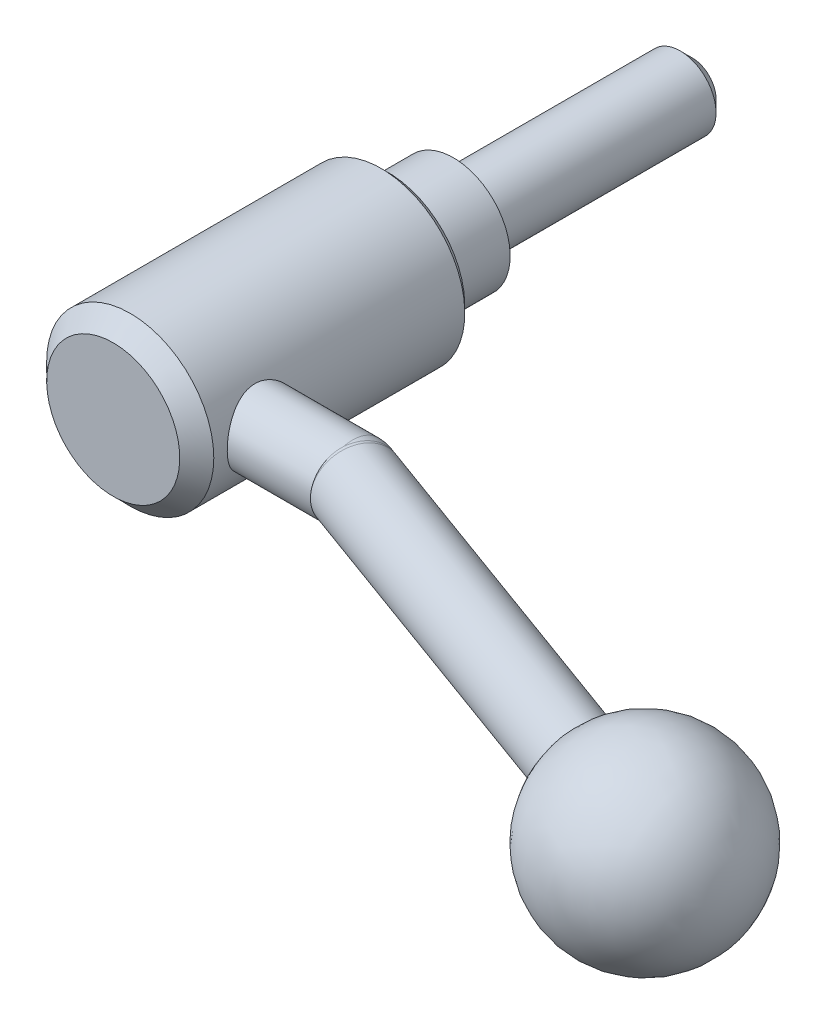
ISO-10303-21;
HEADER;
FILE_DESCRIPTION(('STEP AP214'),'2;1');
FILE_NAME('part.step','',(''),(''),'','','');
FILE_SCHEMA(('AUTOMOTIVE_DESIGN { 1 0 10303 214 1 1 1 1 }'));
ENDSEC;
DATA;
#1=APPLICATION_CONTEXT('core data for automotive mechanical design processes');
#2=APPLICATION_PROTOCOL_DEFINITION('international standard','automotive_design',2000,#1);
#3=PRODUCT_CONTEXT('',#1,'mechanical');
#4=PRODUCT('Part','Part','',(#3));
#5=PRODUCT_RELATED_PRODUCT_CATEGORY('part','',(#4));
#6=PRODUCT_DEFINITION_FORMATION('','',#4);
#7=PRODUCT_DEFINITION_CONTEXT('part definition',#1,'design');
#8=PRODUCT_DEFINITION('design','',#6,#7);
#9=PRODUCT_DEFINITION_SHAPE('','',#8);
#10=(LENGTH_UNIT() NAMED_UNIT(*) SI_UNIT(.MILLI.,.METRE.));
#11=(NAMED_UNIT(*) PLANE_ANGLE_UNIT() SI_UNIT($,.RADIAN.));
#12=(NAMED_UNIT(*) SI_UNIT($,.STERADIAN.) SOLID_ANGLE_UNIT());
#13=UNCERTAINTY_MEASURE_WITH_UNIT(LENGTH_MEASURE(1.E-05),#10,'distance_accuracy_value','');
#14=(GEOMETRIC_REPRESENTATION_CONTEXT(3) GLOBAL_UNCERTAINTY_ASSIGNED_CONTEXT((#13)) GLOBAL_UNIT_ASSIGNED_CONTEXT((#10,
#11,#12)) REPRESENTATION_CONTEXT('',''));
#15=CARTESIAN_POINT('',(0.,0.,0.));
#16=DIRECTION('',(0.,0.,1.));
#17=DIRECTION('',(1.,0.,0.));
#18=AXIS2_PLACEMENT_3D('',#15,#16,#17);
#19=CARTESIAN_POINT('',(0.,0.,-19.463244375));
#20=DIRECTION('',(0.,0.,1.));
#21=DIRECTION('',(0.,-1.,0.));
#22=AXIS2_PLACEMENT_3D('',#19,#20,#21);
#23=CYLINDRICAL_SURFACE('',#22,6.);
#24=CARTESIAN_POINT('',(0.,0.,-38.));
#25=DIRECTION('',(0.,0.,-1.));
#26=DIRECTION('',(-1.,0.,0.));
#27=AXIS2_PLACEMENT_3D('',#24,#25,#26);
#28=CIRCLE('',#27,6.);
#29=CARTESIAN_POINT('',(-6.,0.,-38.));
#30=VERTEX_POINT('',#29);
#31=EDGE_CURVE('E9',#30,#30,#28,.F.);
#32=ORIENTED_EDGE('',*,*,#31,.T.);
#33=EDGE_LOOP('',(#32));
#34=FACE_BOUND('',#33,.T.);
#35=CARTESIAN_POINT('',(0.,0.,0.));
#36=DIRECTION('',(0.,0.,1.));
#37=DIRECTION('',(0.,-1.,0.));
#38=AXIS2_PLACEMENT_3D('',#35,#36,#37);
#39=CIRCLE('',#38,6.);
#40=CARTESIAN_POINT('',(0.,-6.,0.));
#41=VERTEX_POINT('',#40);
#42=EDGE_CURVE('E144',#41,#41,#39,.T.);
#43=ORIENTED_EDGE('',*,*,#42,.F.);
#44=EDGE_LOOP('',(#43));
#45=FACE_BOUND('',#44,.T.);
#46=ADVANCED_FACE('F14',(#34,#45),#23,.T.);
#47=CARTESIAN_POINT('',(7.75,0.,0.));
#48=DIRECTION('',(0.,0.,-1.));
#49=DIRECTION('',(0.,1.,0.));
#50=AXIS2_PLACEMENT_3D('',#47,#48,#49);
#51=PLANE('',#50);
#52=ORIENTED_EDGE('',*,*,#42,.T.);
#53=EDGE_LOOP('',(#52));
#54=FACE_BOUND('',#53,.T.);
#55=CARTESIAN_POINT('',(0.,0.,0.));
#56=DIRECTION('',(0.,0.,1.));
#57=DIRECTION('',(0.,-1.,0.));
#58=AXIS2_PLACEMENT_3D('',#55,#56,#57);
#59=CIRCLE('',#58,9.5);
#60=CARTESIAN_POINT('',(0.,-9.5,0.));
#61=VERTEX_POINT('',#60);
#62=EDGE_CURVE('E141',#61,#61,#59,.T.);
#63=ORIENTED_EDGE('',*,*,#62,.F.);
#64=EDGE_LOOP('',(#63));
#65=FACE_BOUND('',#64,.T.);
#66=ADVANCED_FACE('F148',(#54,#65),#51,.T.);
#67=CARTESIAN_POINT('',(0.,0.,5.5));
#68=DIRECTION('',(0.,0.,1.));
#69=DIRECTION('',(0.,-1.,0.));
#70=AXIS2_PLACEMENT_3D('',#67,#68,#69);
#71=CYLINDRICAL_SURFACE('',#70,9.5);
#72=CARTESIAN_POINT('',(0.,0.,11.));
#73=DIRECTION('',(0.,0.,1.));
#74=DIRECTION('',(0.,-1.,0.));
#75=AXIS2_PLACEMENT_3D('',#72,#73,#74);
#76=CIRCLE('',#75,9.5);
#77=CARTESIAN_POINT('',(0.,-9.5,11.));
#78=VERTEX_POINT('',#77);
#79=EDGE_CURVE('E136',#78,#78,#76,.T.);
#80=ORIENTED_EDGE('',*,*,#79,.F.);
#81=EDGE_LOOP('',(#80));
#82=FACE_BOUND('',#81,.T.);
#83=ORIENTED_EDGE('',*,*,#62,.T.);
#84=EDGE_LOOP('',(#83));
#85=FACE_BOUND('',#84,.T.);
#86=ADVANCED_FACE('F158',(#82,#85),#71,.T.);
#87=CARTESIAN_POINT('',(11.2,0.,11.));
#88=DIRECTION('',(0.,0.,-1.));
#89=DIRECTION('',(0.,1.,0.));
#90=AXIS2_PLACEMENT_3D('',#87,#88,#89);
#91=PLANE('',#90);
#92=ORIENTED_EDGE('',*,*,#79,.T.);
#93=EDGE_LOOP('',(#92));
#94=FACE_BOUND('',#93,.T.);
#95=CARTESIAN_POINT('',(0.,0.,11.));
#96=DIRECTION('',(0.,0.,1.));
#97=DIRECTION('',(0.,-1.,0.));
#98=AXIS2_PLACEMENT_3D('',#95,#96,#97);
#99=CIRCLE('',#98,12.9);
#100=CARTESIAN_POINT('',(0.,-12.9,11.));
#101=VERTEX_POINT('',#100);
#102=EDGE_CURVE('E134',#101,#101,#99,.T.);
#103=ORIENTED_EDGE('',*,*,#102,.F.);
#104=EDGE_LOOP('',(#103));
#105=FACE_BOUND('',#104,.T.);
#106=ADVANCED_FACE('F163',(#94,#105),#91,.T.);
#107=CARTESIAN_POINT('',(5.575,0.,57.));
#108=DIRECTION('',(0.,0.,1.));
#109=DIRECTION('',(0.,-1.,0.));
#110=AXIS2_PLACEMENT_3D('',#107,#108,#109);
#111=PLANE('',#110);
#112=CARTESIAN_POINT('',(0.,0.,57.));
#113=DIRECTION('',(0.,0.,-1.));
#114=DIRECTION('',(0.,1.,0.));
#115=AXIS2_PLACEMENT_3D('',#112,#113,#114);
#116=CIRCLE('',#115,11.15);
#117=CARTESIAN_POINT('',(0.,11.15,57.));
#118=VERTEX_POINT('',#117);
#119=EDGE_CURVE('E118',#118,#118,#116,.T.);
#120=ORIENTED_EDGE('',*,*,#119,.F.);
#121=EDGE_LOOP('',(#120));
#122=FACE_BOUND('',#121,.T.);
#123=ADVANCED_FACE('F167',(#122),#111,.T.);
#124=CARTESIAN_POINT('',(0.,0.,12.1));
#125=DIRECTION('',(0.,0.,1.));
#126=DIRECTION('',(0.,-1.,0.));
#127=AXIS2_PLACEMENT_3D('',#124,#125,#126);
#128=CONICAL_SURFACE('',#127,14.,0.785398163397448);
#129=ORIENTED_EDGE('',*,*,#102,.T.);
#130=EDGE_LOOP('',(#129));
#131=FACE_BOUND('',#130,.T.);
#132=CARTESIAN_POINT('',(0.,0.,12.1));
#133=DIRECTION('',(0.,0.,1.));
#134=DIRECTION('',(0.,-1.,0.));
#135=AXIS2_PLACEMENT_3D('',#132,#133,#134);
#136=CIRCLE('',#135,14.);
#137=CARTESIAN_POINT('',(0.,-14.,12.1));
#138=VERTEX_POINT('',#137);
#139=EDGE_CURVE('E111',#138,#138,#136,.T.);
#140=ORIENTED_EDGE('',*,*,#139,.F.);
#141=EDGE_LOOP('',(#140));
#142=FACE_BOUND('',#141,.T.);
#143=ADVANCED_FACE('F129',(#131,#142),#128,.T.);
#144=CARTESIAN_POINT('',(0.,0.,54.15));
#145=DIRECTION('',(0.,0.,-1.));
#146=DIRECTION('',(0.,1.,0.));
#147=AXIS2_PLACEMENT_3D('',#144,#145,#146);
#148=CONICAL_SURFACE('',#147,14.,0.785398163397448);
#149=CARTESIAN_POINT('',(0.,0.,54.15));
#150=DIRECTION('',(0.,0.,1.));
#151=DIRECTION('',(0.,-1.,0.));
#152=AXIS2_PLACEMENT_3D('',#149,#150,#151);
#153=CIRCLE('',#152,14.);
#154=CARTESIAN_POINT('',(0.,-14.,54.15));
#155=VERTEX_POINT('',#154);
#156=EDGE_CURVE('E47',#155,#155,#153,.F.);
#157=ORIENTED_EDGE('',*,*,#156,.F.);
#158=EDGE_LOOP('',(#157));
#159=FACE_BOUND('',#158,.T.);
#160=ORIENTED_EDGE('',*,*,#119,.T.);
#161=EDGE_LOOP('',(#160));
#162=FACE_BOUND('',#161,.T.);
#163=ADVANCED_FACE('F126',(#159,#162),#148,.T.);
#164=CARTESIAN_POINT('',(0.,0.,33.125));
#165=DIRECTION('',(0.,0.,1.));
#166=DIRECTION('',(0.,-1.,0.));
#167=AXIS2_PLACEMENT_3D('',#164,#165,#166);
#168=CYLINDRICAL_SURFACE('',#167,14.);
#169=ORIENTED_EDGE('',*,*,#139,.T.);
#170=EDGE_LOOP('',(#169));
#171=FACE_BOUND('',#170,.T.);
#172=ORIENTED_EDGE('',*,*,#156,.T.);
#173=EDGE_LOOP('',(#172));
#174=FACE_BOUND('',#173,.T.);
#175=CARTESIAN_POINT('',(12.6491106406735,-6.,45.9));
#176=CARTESIAN_POINT('',(12.64910460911,-6.00000553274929,45.7401576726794));
#177=CARTESIAN_POINT('',(12.6521467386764,-5.99360993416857,45.5803670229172));
#178=CARTESIAN_POINT('',(12.6641937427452,-5.96811672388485,45.2619820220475));
#179=CARTESIAN_POINT('',(12.6731994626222,-5.94901731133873,45.103387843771));
#180=CARTESIAN_POINT('',(12.6968742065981,-5.89831833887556,44.7885665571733));
#181=CARTESIAN_POINT('',(12.7115461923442,-5.86671224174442,44.6323407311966));
#182=CARTESIAN_POINT('',(12.746064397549,-5.79133489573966,44.3233778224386));
#183=CARTESIAN_POINT('',(12.7659126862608,-5.74755878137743,44.1706421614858));
#184=CARTESIAN_POINT('',(12.8100610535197,-5.64847418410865,43.870311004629));
#185=CARTESIAN_POINT('',(12.834343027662,-5.59321247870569,43.7226974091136));
#186=CARTESIAN_POINT('',(12.8866851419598,-5.47153830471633,43.432812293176));
#187=CARTESIAN_POINT('',(12.9147467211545,-5.4051215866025,43.2905428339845));
#188=CARTESIAN_POINT('',(13.0034189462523,-5.18991043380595,42.8730011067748));
#189=CARTESIAN_POINT('',(13.0685550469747,-5.02507375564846,42.6067513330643));
#190=CARTESIAN_POINT('',(13.2082253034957,-4.64606613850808,42.0890653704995));
#191=CARTESIAN_POINT('',(13.2830881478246,-4.42954152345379,41.8394560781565));
#192=CARTESIAN_POINT('',(13.4311388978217,-3.95795352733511,41.3785903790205));
#193=CARTESIAN_POINT('',(13.5043260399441,-3.70287296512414,41.1673511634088));
#194=CARTESIAN_POINT('',(13.6088643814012,-3.28944046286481,40.8790751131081));
#195=CARTESIAN_POINT('',(13.6435464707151,-3.14284381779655,40.7860210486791));
#196=CARTESIAN_POINT('',(13.7094572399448,-2.84156827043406,40.6126899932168));
#197=CARTESIAN_POINT('',(13.7406873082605,-2.68689265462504,40.5324078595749));
#198=CARTESIAN_POINT('',(13.7987727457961,-2.37059090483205,40.3854112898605));
#199=CARTESIAN_POINT('',(13.8256317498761,-2.20897068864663,40.3186855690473));
#200=CARTESIAN_POINT('',(13.8742091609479,-1.87989388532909,40.199418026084));
#201=CARTESIAN_POINT('',(13.8959288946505,-1.71243881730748,40.14687254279));
#202=CARTESIAN_POINT('',(13.9424931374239,-1.29234447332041,40.0351169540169));
#203=CARTESIAN_POINT('',(13.9639369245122,-1.03695928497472,39.9845583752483));
#204=CARTESIAN_POINT('',(13.9926857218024,-0.521004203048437,39.9170068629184));
#205=CARTESIAN_POINT('',(13.9999930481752,-0.260435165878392,39.9000084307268));
#206=CARTESIAN_POINT('',(14.0000042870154,0.160603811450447,39.899994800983));
#207=CARTESIAN_POINT('',(13.9972323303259,0.321156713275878,39.9064506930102));
#208=CARTESIAN_POINT('',(13.9862285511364,0.641089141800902,39.9321914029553));
#209=CARTESIAN_POINT('',(13.9779959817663,0.80046850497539,39.9514779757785));
#210=CARTESIAN_POINT('',(13.9562800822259,1.11687883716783,40.0026881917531));
#211=CARTESIAN_POINT('',(13.9427945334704,1.27390878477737,40.0346171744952));
#212=CARTESIAN_POINT('',(13.9109210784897,1.58450451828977,40.1107925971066));
#213=CARTESIAN_POINT('',(13.8925312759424,1.73806893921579,40.1550438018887));
#214=CARTESIAN_POINT('',(13.8513869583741,2.04015832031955,40.2552679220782));
#215=CARTESIAN_POINT('',(13.8286466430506,2.1886978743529,40.3112027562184));
#216=CARTESIAN_POINT('',(13.7793155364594,2.48039457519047,40.4344055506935));
#217=CARTESIAN_POINT('',(13.7527233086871,2.62354968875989,40.5016777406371));
#218=CARTESIAN_POINT('',(13.696336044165,2.90357801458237,40.6469909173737));
#219=CARTESIAN_POINT('',(13.6665419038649,3.04045296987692,40.7250288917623));
#220=CARTESIAN_POINT('',(13.6044405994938,3.30726420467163,40.8913329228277));
#221=CARTESIAN_POINT('',(13.5721325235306,3.43719793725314,40.9796026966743));
#222=CARTESIAN_POINT('',(13.4693866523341,3.82753947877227,41.2677581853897));
#223=CARTESIAN_POINT('',(13.3958896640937,4.07523678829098,41.4841392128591));
#224=CARTESIAN_POINT('',(13.2483283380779,4.53206518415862,41.9543804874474));
#225=CARTESIAN_POINT('',(13.1742637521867,4.74117826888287,42.2082581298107));
#226=CARTESIAN_POINT('',(13.0667151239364,5.02713542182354,42.6200780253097));
#227=CARTESIAN_POINT('',(13.0306067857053,5.11975828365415,42.7665983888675));
#228=CARTESIAN_POINT('',(12.9615135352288,5.2922387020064,43.0676393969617));
#229=CARTESIAN_POINT('',(12.9285273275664,5.3721015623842,43.222156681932));
#230=CARTESIAN_POINT('',(12.8667726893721,5.51837579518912,43.5382497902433));
#231=CARTESIAN_POINT('',(12.8380044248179,5.58478663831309,43.699825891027));
#232=CARTESIAN_POINT('',(12.7857296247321,5.70344853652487,44.028841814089));
#233=CARTESIAN_POINT('',(12.7622203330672,5.75570701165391,44.1962785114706));
#234=CARTESIAN_POINT('',(12.7223620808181,5.84326126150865,44.5273582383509));
#235=CARTESIAN_POINT('',(12.7057155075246,5.87927054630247,44.6907767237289));
#236=CARTESIAN_POINT('',(12.6785875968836,5.9375461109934,45.0204810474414));
#237=CARTESIAN_POINT('',(12.668103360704,5.95981885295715,45.1867654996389));
#238=CARTESIAN_POINT('',(12.6536916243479,5.99035682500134,45.520851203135));
#239=CARTESIAN_POINT('',(12.6497622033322,5.99862615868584,45.6886519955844));
#240=CARTESIAN_POINT('',(12.6486085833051,6.00105865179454,46.0243741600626));
#241=CARTESIAN_POINT('',(12.6513839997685,5.99522262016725,46.1922955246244));
#242=CARTESIAN_POINT('',(12.6630276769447,5.97058551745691,46.5130358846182));
#243=CARTESIAN_POINT('',(12.6713756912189,5.95289101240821,46.6659604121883));
#244=CARTESIAN_POINT('',(12.6933550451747,5.90587935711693,46.9696771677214));
#245=CARTESIAN_POINT('',(12.7069881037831,5.87655842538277,47.120468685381));
#246=CARTESIAN_POINT('',(12.7391074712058,5.80660124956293,47.4188341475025));
#247=CARTESIAN_POINT('',(12.7575927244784,5.76596746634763,47.5664087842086));
#248=CARTESIAN_POINT('',(12.7988726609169,5.67374743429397,47.8575287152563));
#249=CARTESIAN_POINT('',(12.8216690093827,5.62215695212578,48.0010724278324));
#250=CARTESIAN_POINT('',(12.8714548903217,5.50723592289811,48.2863126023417));
#251=CARTESIAN_POINT('',(12.8985238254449,5.44367744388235,48.4279035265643));
#252=CARTESIAN_POINT('',(12.9557327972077,5.3060860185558,48.7052555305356));
#253=CARTESIAN_POINT('',(12.9858738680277,5.23204954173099,48.8410146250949));
#254=CARTESIAN_POINT('',(13.0797518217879,4.99489125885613,49.238579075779));
#255=CARTESIAN_POINT('',(13.1469738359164,4.81665343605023,49.4908372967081));
#256=CARTESIAN_POINT('',(13.2528981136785,4.51370688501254,49.8565947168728));
#257=CARTESIAN_POINT('',(13.2906740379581,4.40149613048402,49.9810439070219));
#258=CARTESIAN_POINT('',(13.3660382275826,4.16703298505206,50.2201648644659));
#259=CARTESIAN_POINT('',(13.4036265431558,4.04478345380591,50.3348393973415));
#260=CARTESIAN_POINT('',(13.4776589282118,3.79080787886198,50.5538078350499));
#261=CARTESIAN_POINT('',(13.5141019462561,3.65907347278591,50.6580923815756));
#262=CARTESIAN_POINT('',(13.5848454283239,3.38699289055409,50.8554522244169));
#263=CARTESIAN_POINT('',(13.6191467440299,3.24665018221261,50.9485319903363));
#264=CARTESIAN_POINT('',(13.6855986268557,2.95422844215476,51.1251783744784));
#265=CARTESIAN_POINT('',(13.7176667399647,2.80193548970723,51.2084225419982));
#266=CARTESIAN_POINT('',(13.7776826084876,2.49011177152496,51.3616394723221));
#267=CARTESIAN_POINT('',(13.805632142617,2.33058416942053,51.4316179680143));
#268=CARTESIAN_POINT('',(13.8565730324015,2.00558982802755,51.5575551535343));
#269=CARTESIAN_POINT('',(13.8795716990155,1.8401322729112,51.6135345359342));
#270=CARTESIAN_POINT('',(13.9199625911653,1.50439957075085,51.7109657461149));
#271=CARTESIAN_POINT('',(13.9373571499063,1.3341264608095,51.7524236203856));
#272=CARTESIAN_POINT('',(13.9675766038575,0.971306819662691,51.8240504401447));
#273=CARTESIAN_POINT('',(13.9796957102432,0.778357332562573,51.852493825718));
#274=CARTESIAN_POINT('',(13.9959066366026,0.390262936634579,51.8904675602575));
#275=CARTESIAN_POINT('',(13.9999986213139,0.195118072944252,51.8999982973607));
#276=CARTESIAN_POINT('',(14.0000011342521,-0.160524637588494,51.90000140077));
#277=CARTESIAN_POINT('',(13.9972335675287,-0.321031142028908,51.8935531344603));
#278=CARTESIAN_POINT('',(13.986238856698,-0.64087897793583,51.8678317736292));
#279=CARTESIAN_POINT('',(13.9780101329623,-0.800219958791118,51.8485549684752));
#280=CARTESIAN_POINT('',(13.9562992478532,-1.11664192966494,51.7973574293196));
#281=CARTESIAN_POINT('',(13.9428121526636,-1.27372065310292,51.7654248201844));
#282=CARTESIAN_POINT('',(13.9109322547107,-1.5844120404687,51.6892342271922));
#283=CARTESIAN_POINT('',(13.8925375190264,-1.73802331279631,51.6449713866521));
#284=CARTESIAN_POINT('',(13.8513855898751,-2.04016815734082,51.5447287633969));
#285=CARTESIAN_POINT('',(13.8286436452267,-2.18871740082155,51.4887898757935));
#286=CARTESIAN_POINT('',(13.7793086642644,-2.48043340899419,51.3655771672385));
#287=CARTESIAN_POINT('',(13.7527141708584,-2.6235981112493,51.2982990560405));
#288=CARTESIAN_POINT('',(13.6963259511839,-2.90362509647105,51.1529827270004));
#289=CARTESIAN_POINT('',(13.6665335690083,-3.04048999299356,51.074949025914));
#290=CARTESIAN_POINT('',(13.6044361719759,-3.30728201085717,50.9086549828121));
#291=CARTESIAN_POINT('',(13.5721302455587,-3.43720658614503,50.820390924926));
#292=CARTESIAN_POINT('',(13.4693921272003,-3.82751869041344,50.5322571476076));
#293=CARTESIAN_POINT('',(13.3959012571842,-4.07519777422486,50.3158947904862));
#294=CARTESIAN_POINT('',(13.2483400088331,-4.53203219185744,49.8456596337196));
#295=CARTESIAN_POINT('',(13.1742692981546,-4.74116344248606,49.5917635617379));
#296=CARTESIAN_POINT('',(13.0666998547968,-5.02717606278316,49.1798632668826));
#297=CARTESIAN_POINT('',(13.0305770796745,-5.11983460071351,49.0332803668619));
#298=CARTESIAN_POINT('',(12.9614574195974,-5.29237662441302,48.7321079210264));
#299=CARTESIAN_POINT('',(12.9284592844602,-5.37226522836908,48.5775216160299));
#300=CARTESIAN_POINT('',(12.8667153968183,-5.51850899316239,48.2614303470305));
#301=CARTESIAN_POINT('',(12.8379657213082,-5.5848766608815,48.0999319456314));
#302=CARTESIAN_POINT('',(12.7857155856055,-5.70347823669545,47.7710683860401));
#303=CARTESIAN_POINT('',(12.7622136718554,-5.75571605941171,47.6037048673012));
#304=CARTESIAN_POINT('',(12.7118372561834,-5.86638870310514,47.1851613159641));
#305=CARTESIAN_POINT('',(12.6884912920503,-5.91637540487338,46.9312534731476));
#306=CARTESIAN_POINT('',(12.657134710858,-5.9831725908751,46.418184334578));
#307=CARTESIAN_POINT('',(12.6491204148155,-5.99999103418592,46.1590243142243));
#308=CARTESIAN_POINT('',(12.6491106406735,-6.,45.9));
#309=B_SPLINE_CURVE_WITH_KNOTS('',3,(#175,#176,#177,#178,#179,#180,#181,#182,#183,#184,#185,
#186,#187,#188,#189,#190,#191,#192,#193,#194,#195,#196,#197,#198,#199,#200,#201,#202,#203,#204,
#205,#206,#207,#208,#209,#210,#211,#212,#213,#214,#215,#216,#217,#218,#219,#220,#221,#222,#223,
#224,#225,#226,#227,#228,#229,#230,#231,#232,#233,#234,#235,#236,#237,#238,#239,#240,#241,#242,
#243,#244,#245,#246,#247,#248,#249,#250,#251,#252,#253,#254,#255,#256,#257,#258,#259,#260,#261,
#262,#263,#264,#265,#266,#267,#268,#269,#270,#271,#272,#273,#274,#275,#276,#277,#278,#279,#280,
#281,#282,#283,#284,#285,#286,#287,#288,#289,#290,#291,#292,#293,#294,#295,#296,#297,#298,#299,
#300,#301,#302,#303,#304,#305,#306,#307,#308),.UNSPECIFIED.,.T.,.F.,(4,2,2,2,2,2,2,2,2,2,2,2,2,
2,2,2,2,2,2,2,2,2,2,2,2,2,2,2,2,2,2,2,2,2,2,2,2,2,2,2,2,2,2,2,2,2,2,2,2,2,2,2,2,2,2,2,2,2,2,2,2,
2,2,2,2,2,4),(0.,0.479282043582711,0.958632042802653,1.43823292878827,1.9180258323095,
2.3959016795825,2.87395998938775,3.82930518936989,4.84155293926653,5.85425310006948,
6.38488729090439,6.91530727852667,7.44528390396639,7.97512356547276,8.7561667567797,
9.53708196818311,10.0186527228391,10.5002893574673,10.9821296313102,11.4641564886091,
11.9446360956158,12.4252953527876,12.9058203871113,13.386520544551,14.3929183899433,
15.3997845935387,15.9304063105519,16.4608068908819,16.9912283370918,17.5213711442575,
18.0251862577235,18.5287641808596,19.032194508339,19.5355959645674,19.9975669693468,
20.4596883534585,20.921709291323,21.3839090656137,21.856015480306,22.3282813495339,
23.27227458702,23.7871505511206,24.3018803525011,24.8170696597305,25.3320527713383,
25.860860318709,26.3894388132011,26.9172313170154,27.4448037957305,28.029946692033,
28.6150775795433,29.0964677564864,29.5779972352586,30.0599796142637,30.5421521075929,
31.0226633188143,31.5033567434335,31.9838489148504,32.4645161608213,33.4708348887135,
34.4777802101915,35.008620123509,35.5392467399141,36.0693802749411,36.599366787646,
37.3762292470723,38.1529052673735),.UNSPECIFIED.);
#310=CARTESIAN_POINT('',(12.6491106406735,-6.,45.9));
#311=VERTEX_POINT('',#310);
#312=EDGE_CURVE('E46',#311,#311,#309,.T.);
#313=ORIENTED_EDGE('',*,*,#312,.F.);
#314=EDGE_LOOP('',(#313));
#315=FACE_BOUND('',#314,.T.);
#316=ADVANCED_FACE('F123',(#171,#174,#315),#168,.T.);
#317=CARTESIAN_POINT('',(29.,0.,45.9));
#318=DIRECTION('',(1.,0.,0.));
#319=DIRECTION('',(0.,0.,1.));
#320=AXIS2_PLACEMENT_3D('',#317,#318,#319);
#321=SPHERICAL_SURFACE('',#320,6.);
#322=CARTESIAN_POINT('',(29.,0.,45.9));
#323=DIRECTION('',(-1.,0.,0.));
#324=DIRECTION('',(0.,-1.,0.));
#325=AXIS2_PLACEMENT_3D('',#322,#323,#324);
#326=CIRCLE('',#325,6.);
#327=CARTESIAN_POINT('',(29.,5.79723335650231,47.4466368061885));
#328=VERTEX_POINT('',#327);
#329=CARTESIAN_POINT('',(29.,-5.79723335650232,47.4466368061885));
#330=VERTEX_POINT('',#329);
#331=EDGE_CURVE('E35',#328,#330,#326,.T.);
#332=ORIENTED_EDGE('',*,*,#331,.F.);
#333=CARTESIAN_POINT('',(29.,-5.79723335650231,47.4466368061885));
#334=CARTESIAN_POINT('',(29.0557645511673,-5.83812719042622,47.2934249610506));
#335=CARTESIAN_POINT('',(29.1121209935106,-5.87210735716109,47.1385869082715));
#336=CARTESIAN_POINT('',(29.2256095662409,-5.92607580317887,46.826779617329));
#337=CARTESIAN_POINT('',(29.2827416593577,-5.94606475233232,46.6698104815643));
#338=CARTESIAN_POINT('',(29.397338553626,-5.97188107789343,46.3549581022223));
#339=CARTESIAN_POINT('',(29.4548030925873,-5.97771840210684,46.1970755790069));
#340=CARTESIAN_POINT('',(29.5696954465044,-5.97522465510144,45.8814114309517));
#341=CARTESIAN_POINT('',(29.6271232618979,-5.96689375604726,45.7236298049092));
#342=CARTESIAN_POINT('',(29.7415513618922,-5.93611715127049,45.4092411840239));
#343=CARTESIAN_POINT('',(29.7985515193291,-5.91366740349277,45.2526345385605));
#344=CARTESIAN_POINT('',(29.9117233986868,-5.85479849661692,44.9416973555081));
#345=CARTESIAN_POINT('',(29.9678948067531,-5.81837417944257,44.7873676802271));
#346=CARTESIAN_POINT('',(30.07895660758,-5.73184022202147,44.482227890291));
#347=CARTESIAN_POINT('',(30.1338477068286,-5.68173833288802,44.3314158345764));
#348=CARTESIAN_POINT('',(30.2420117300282,-5.56817525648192,44.0342376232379));
#349=CARTESIAN_POINT('',(30.2952840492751,-5.50470914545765,43.8878731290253));
#350=CARTESIAN_POINT('',(30.3997923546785,-5.36490433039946,43.6007389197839));
#351=CARTESIAN_POINT('',(30.4510290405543,-5.28857009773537,43.4599672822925));
#352=CARTESIAN_POINT('',(30.5511400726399,-5.12352558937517,43.1849144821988));
#353=CARTESIAN_POINT('',(30.6000135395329,-5.03481075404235,43.0506357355));
#354=CARTESIAN_POINT('',(30.6950199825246,-4.84567787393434,42.7896076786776));
#355=CARTESIAN_POINT('',(30.741153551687,-4.74526237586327,42.6628567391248));
#356=CARTESIAN_POINT('',(30.8303803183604,-4.53338722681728,42.4177082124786));
#357=CARTESIAN_POINT('',(30.8734723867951,-4.4219235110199,42.2993137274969));
#358=CARTESIAN_POINT('',(30.9562737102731,-4.18882415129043,42.0718189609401));
#359=CARTESIAN_POINT('',(30.9959843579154,-4.06719273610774,41.9627148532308));
#360=CARTESIAN_POINT('',(31.0717745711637,-3.81453588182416,41.7544829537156));
#361=CARTESIAN_POINT('',(31.1078527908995,-3.68350699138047,41.6553588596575));
#362=CARTESIAN_POINT('',(31.1760900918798,-3.41308529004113,41.4678784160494));
#363=CARTESIAN_POINT('',(31.2082508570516,-3.27369611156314,41.3795174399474));
#364=CARTESIAN_POINT('',(31.2684539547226,-2.98744059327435,41.2141107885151));
#365=CARTESIAN_POINT('',(31.2964947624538,-2.84057151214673,41.1370693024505));
#366=CARTESIAN_POINT('',(31.3482353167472,-2.54049920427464,40.9949132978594));
#367=CARTESIAN_POINT('',(31.371936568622,-2.3872981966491,40.9297946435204));
#368=CARTESIAN_POINT('',(31.4148496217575,-2.07554959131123,40.8118919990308));
#369=CARTESIAN_POINT('',(31.4340597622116,-1.91700004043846,40.7591125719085));
#370=CARTESIAN_POINT('',(31.4678364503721,-1.59577604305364,40.6663118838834));
#371=CARTESIAN_POINT('',(31.482404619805,-1.43310305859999,40.6262861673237));
#372=CARTESIAN_POINT('',(31.5068088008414,-1.10473356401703,40.5592362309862));
#373=CARTESIAN_POINT('',(31.5166430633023,-0.939035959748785,40.532216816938));
#374=CARTESIAN_POINT('',(31.5389073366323,-0.439292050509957,40.4710462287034));
#375=CARTESIAN_POINT('',(31.5441357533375,-0.102242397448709,40.4566812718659));
#376=CARTESIAN_POINT('',(31.5351589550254,0.569455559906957,40.4813448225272));
#377=CARTESIAN_POINT('',(31.5209537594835,0.904103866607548,40.520373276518));
#378=CARTESIAN_POINT('',(31.4735308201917,1.56172931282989,40.6506667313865));
#379=CARTESIAN_POINT('',(31.4403129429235,1.88470637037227,40.7419320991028));
#380=CARTESIAN_POINT('',(31.3558032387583,2.50975337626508,40.9741206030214));
#381=CARTESIAN_POINT('',(31.3045116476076,2.81182359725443,41.1150430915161));
#382=CARTESIAN_POINT('',(31.1853123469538,3.38650029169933,41.4425404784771));
#383=CARTESIAN_POINT('',(31.1174048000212,3.65910705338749,41.629114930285));
#384=CARTESIAN_POINT('',(30.9668980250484,4.16712588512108,42.0426288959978));
#385=CARTESIAN_POINT('',(30.8842983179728,4.40253674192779,42.2695697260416));
#386=CARTESIAN_POINT('',(30.7067542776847,4.82947107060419,42.7573679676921));
#387=CARTESIAN_POINT('',(30.6118099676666,5.02099462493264,43.0182253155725));
#388=CARTESIAN_POINT('',(30.4122730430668,5.35471233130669,43.5664485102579));
#389=CARTESIAN_POINT('',(30.3076807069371,5.49690790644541,43.8538135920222));
#390=CARTESIAN_POINT('',(30.0918053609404,5.72795934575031,44.4469262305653));
#391=CARTESIAN_POINT('',(29.9805214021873,5.81680762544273,44.7526763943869));
#392=CARTESIAN_POINT('',(29.7544411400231,5.93858745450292,45.3738268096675));
#393=CARTESIAN_POINT('',(29.6396457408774,5.97153327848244,45.6892245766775));
#394=CARTESIAN_POINT('',(29.4363937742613,5.97959153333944,46.247654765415));
#395=CARTESIAN_POINT('',(29.3479764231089,5.96630208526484,46.4905794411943));
#396=CARTESIAN_POINT('',(29.2164293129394,5.92144536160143,46.8520021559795));
#397=CARTESIAN_POINT('',(29.1727720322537,5.90234809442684,46.9719495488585));
#398=CARTESIAN_POINT('',(29.0859636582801,5.85593456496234,47.2104535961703));
#399=CARTESIAN_POINT('',(29.0428126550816,5.82861686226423,47.3290100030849));
#400=CARTESIAN_POINT('',(29.,5.79723335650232,47.4466368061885));
#401=B_SPLINE_CURVE_WITH_KNOTS('',3,(#333,#334,#335,#336,#337,#338,#339,#340,#341,#342,#343,
#344,#345,#346,#347,#348,#349,#350,#351,#352,#353,#354,#355,#356,#357,#358,#359,#360,#361,#362,
#363,#364,#365,#366,#367,#368,#369,#370,#371,#372,#373,#374,#375,#376,#377,#378,#379,#380,#381,
#382,#383,#384,#385,#386,#387,#388,#389,#390,#391,#392,#393,#394,#395,#396,#397,#398,#399,#400),
.UNSPECIFIED.,.F.,.F.,(4,2,2,2,2,2,2,2,2,2,2,2,2,2,2,2,2,2,2,2,2,2,2,2,2,2,2,2,2,2,2,2,2,4),(0.,
0.504130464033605,1.00823678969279,1.51198865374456,2.01573439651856,2.51962442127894,
3.02370061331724,3.52749173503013,4.03146879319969,4.53527109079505,5.03925942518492,
5.54313826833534,6.04720318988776,6.55105950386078,7.05510182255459,7.55892670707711,
8.06293758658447,8.56677330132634,9.07079504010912,9.57464049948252,10.0786719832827,
11.0856436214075,12.0926142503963,13.0995919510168,14.1065565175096,15.1135112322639,
16.1204987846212,17.127484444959,18.1344410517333,19.141540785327,20.1483833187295,
20.9227248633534,21.3096814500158,21.6967058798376),.UNSPECIFIED.);
#402=EDGE_CURVE('E49',#330,#328,#401,.T.);
#403=ORIENTED_EDGE('',*,*,#402,.F.);
#404=EDGE_LOOP('',(#332,#403));
#405=FACE_BOUND('',#404,.T.);
#406=ADVANCED_FACE('F50',(#405),#321,.T.);
#407=CARTESIAN_POINT('',(14.5,0.,45.9));
#408=DIRECTION('',(-1.,0.,0.));
#409=DIRECTION('',(0.,-1.,0.));
#410=AXIS2_PLACEMENT_3D('',#407,#408,#409);
#411=CYLINDRICAL_SURFACE('',#410,6.);
#412=CARTESIAN_POINT('',(27.9420381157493,0.,51.9));
#413=CARTESIAN_POINT('',(27.9420394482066,-0.166535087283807,51.9000193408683));
#414=CARTESIAN_POINT('',(27.9432607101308,-0.33306709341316,51.8930673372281));
#415=CARTESIAN_POINT('',(27.9481523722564,-0.664932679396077,51.8653605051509));
#416=CARTESIAN_POINT('',(27.9518226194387,-0.830266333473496,51.8446065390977));
#417=CARTESIAN_POINT('',(27.9616185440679,-1.1584640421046,51.7894524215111));
#418=CARTESIAN_POINT('',(27.9677427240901,-1.3213295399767,51.7550605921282));
#419=CARTESIAN_POINT('',(27.9824660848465,-1.64353559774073,51.6729046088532));
#420=CARTESIAN_POINT('',(27.9910652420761,-1.80287619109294,51.6251405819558));
#421=CARTESIAN_POINT('',(28.0107684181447,-2.11692207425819,51.5166045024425));
#422=CARTESIAN_POINT('',(28.0218726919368,-2.27162689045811,51.4558311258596));
#423=CARTESIAN_POINT('',(28.04663219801,-2.57536385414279,51.321722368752));
#424=CARTESIAN_POINT('',(28.0602885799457,-2.72439340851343,51.2483813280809));
#425=CARTESIAN_POINT('',(28.0902001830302,-3.01561279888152,51.0897555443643));
#426=CARTESIAN_POINT('',(28.1064544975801,-3.15780499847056,51.0044749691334));
#427=CARTESIAN_POINT('',(28.1416340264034,-3.4343587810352,50.8226570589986));
#428=CARTESIAN_POINT('',(28.1605580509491,-3.56872381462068,50.7261247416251));
#429=CARTESIAN_POINT('',(28.2012637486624,-3.82927101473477,50.522138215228));
#430=CARTESIAN_POINT('',(28.2230560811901,-3.95541989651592,50.414643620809));
#431=CARTESIAN_POINT('',(28.2695844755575,-4.1981145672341,50.189893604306));
#432=CARTESIAN_POINT('',(28.2943205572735,-4.31466029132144,50.0726381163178));
#433=CARTESIAN_POINT('',(28.3469412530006,-4.53741042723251,49.8292656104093));
#434=CARTESIAN_POINT('',(28.3748269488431,-4.64361126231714,49.7031455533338));
#435=CARTESIAN_POINT('',(28.4340144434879,-4.84493909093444,49.4431060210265));
#436=CARTESIAN_POINT('',(28.4653162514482,-4.94006605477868,49.3091865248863));
#437=CARTESIAN_POINT('',(28.5310255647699,-5.11676279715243,49.0375840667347));
#438=CARTESIAN_POINT('',(28.5653535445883,-5.19857640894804,48.9000402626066));
#439=CARTESIAN_POINT('',(28.6381984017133,-5.3505642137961,48.6197177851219));
#440=CARTESIAN_POINT('',(28.6767149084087,-5.42073943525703,48.4769395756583));
#441=CARTESIAN_POINT('',(28.7382572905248,-5.51700566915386,48.2598578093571));
#442=CARTESIAN_POINT('',(28.7594066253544,-5.5476032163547,48.1869880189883));
#443=CARTESIAN_POINT('',(28.8031193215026,-5.60576725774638,48.0404635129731));
#444=CARTESIAN_POINT('',(28.825682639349,-5.63333384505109,47.9668088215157));
#445=CARTESIAN_POINT('',(28.8724170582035,-5.68541693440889,47.8189007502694));
#446=CARTESIAN_POINT('',(28.8965887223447,-5.70993235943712,47.7446471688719));
#447=CARTESIAN_POINT('',(28.9468138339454,-5.75589127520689,47.5958172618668));
#448=CARTESIAN_POINT('',(28.9728674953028,-5.77733441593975,47.521240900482));
#449=CARTESIAN_POINT('',(29.,-5.79723335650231,47.4466368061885));
#450=B_SPLINE_CURVE_WITH_KNOTS('',3,(#412,#413,#414,#415,#416,#417,#418,#419,#420,#421,#422,
#423,#424,#425,#426,#427,#428,#429,#430,#431,#432,#433,#434,#435,#436,#437,#438,#439,#440,#441,
#442,#443,#444,#445,#446,#447,#448,#449),.UNSPECIFIED.,.F.,.F.,(4,2,2,2,2,2,2,2,2,2,2,2,2,2,2,2,
2,2,4),(0.,0.499451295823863,0.998871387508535,1.49798718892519,1.99709825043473,
2.49626013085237,2.99564741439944,3.49486080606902,3.99385242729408,4.49475374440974,
4.99565844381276,5.49673572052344,5.99781434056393,6.48831347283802,6.97876923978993,
7.22415206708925,7.46952735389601,7.71498901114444,7.96047861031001),.UNSPECIFIED.);
#451=CARTESIAN_POINT('',(27.9420381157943,0.,51.9));
#452=VERTEX_POINT('',#451);
#453=EDGE_CURVE('E42',#452,#330,#450,.T.);
#454=ORIENTED_EDGE('',*,*,#453,.F.);
#455=CARTESIAN_POINT('',(29.,5.79723335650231,47.4466368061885));
#456=CARTESIAN_POINT('',(28.9723130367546,5.77692718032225,47.5227686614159));
#457=CARTESIAN_POINT('',(28.9457482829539,5.75501279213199,47.5988708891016));
#458=CARTESIAN_POINT('',(28.8945727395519,5.70798462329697,47.7507333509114));
#459=CARTESIAN_POINT('',(28.8699617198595,5.68287122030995,47.8264936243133));
#460=CARTESIAN_POINT('',(28.8224049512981,5.62946641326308,47.9773816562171));
#461=CARTESIAN_POINT('',(28.7994586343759,5.60117610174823,48.0525096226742));
#462=CARTESIAN_POINT('',(28.7550276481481,5.54144116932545,48.2019353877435));
#463=CARTESIAN_POINT('',(28.7335430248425,5.50999644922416,48.2762331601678));
#464=CARTESIAN_POINT('',(28.6710654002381,5.4110223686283,48.4974817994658));
#465=CARTESIAN_POINT('',(28.6320085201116,5.33880726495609,48.642917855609));
#466=CARTESIAN_POINT('',(28.5582125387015,5.18229062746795,48.928260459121));
#467=CARTESIAN_POINT('',(28.5234737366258,5.09798825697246,49.0681666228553));
#468=CARTESIAN_POINT('',(28.4577828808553,4.91785982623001,49.3411288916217));
#469=CARTESIAN_POINT('',(28.4268278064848,4.82204308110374,49.4741904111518));
#470=CARTESIAN_POINT('',(28.3682949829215,4.61943382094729,49.7324629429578));
#471=CARTESIAN_POINT('',(28.3407171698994,4.51264151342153,49.857674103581));
#472=CARTESIAN_POINT('',(28.2886811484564,4.28880603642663,50.0991954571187));
#473=CARTESIAN_POINT('',(28.2642219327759,4.17176619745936,50.2155085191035));
#474=CARTESIAN_POINT('',(28.2182226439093,3.92818288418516,50.438350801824));
#475=CARTESIAN_POINT('',(28.1966825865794,3.80163935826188,50.5448799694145));
#476=CARTESIAN_POINT('',(28.1561746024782,3.53854954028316,50.7483613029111));
#477=CARTESIAN_POINT('',(28.1372355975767,3.4019132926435,50.8452029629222));
#478=CARTESIAN_POINT('',(28.1020833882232,3.12070655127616,51.0273056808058));
#479=CARTESIAN_POINT('',(28.0858714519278,2.97613240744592,51.1125613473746));
#480=CARTESIAN_POINT('',(28.0561017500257,2.6800837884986,51.2707849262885));
#481=CARTESIAN_POINT('',(28.0425448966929,2.528606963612,51.3437486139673));
#482=CARTESIAN_POINT('',(28.0180414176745,2.21995704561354,51.4767386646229));
#483=CARTESIAN_POINT('',(28.0070935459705,2.06278671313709,51.5367712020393));
#484=CARTESIAN_POINT('',(27.9881595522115,1.7504285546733,51.6412531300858));
#485=CARTESIAN_POINT('',(27.9800695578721,1.59542814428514,51.6862448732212));
#486=CARTESIAN_POINT('',(27.9662176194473,1.2822107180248,51.7636132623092));
#487=CARTESIAN_POINT('',(27.9604556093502,1.12399379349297,51.7959902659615));
#488=CARTESIAN_POINT('',(27.9512410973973,0.805364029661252,51.847893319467));
#489=CARTESIAN_POINT('',(27.9477891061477,0.644950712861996,51.8674165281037));
#490=CARTESIAN_POINT('',(27.9431881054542,0.323025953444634,51.8934789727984));
#491=CARTESIAN_POINT('',(27.9420393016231,0.16151441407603,51.9000170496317));
#492=CARTESIAN_POINT('',(27.9420381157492,0.,51.9));
#493=B_SPLINE_CURVE_WITH_KNOTS('',3,(#455,#456,#457,#458,#459,#460,#461,#462,#463,#464,#465,
#466,#467,#468,#469,#470,#471,#472,#473,#474,#475,#476,#477,#478,#479,#480,#481,#482,#483,#484,
#485,#486,#487,#488,#489,#490,#491,#492),.UNSPECIFIED.,.F.,.F.,(4,2,2,2,2,2,2,2,2,2,2,2,2,2,2,2,
2,2,4),(0.,0.250514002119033,0.500998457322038,0.75139703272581,1.00180348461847,
1.50218745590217,2.0026060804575,2.50262255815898,3.0026295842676,3.50247470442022,
4.00232253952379,4.50734262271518,5.01259690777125,5.51802449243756,6.02321020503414,
6.5074762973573,6.99172865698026,7.47608802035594,7.96049062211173),.UNSPECIFIED.);
#494=EDGE_CURVE('E44',#328,#452,#493,.T.);
#495=ORIENTED_EDGE('',*,*,#494,.F.);
#496=ORIENTED_EDGE('',*,*,#331,.T.);
#497=EDGE_LOOP('',(#454,#495,#496));
#498=FACE_BOUND('',#497,.T.);
#499=ORIENTED_EDGE('',*,*,#312,.T.);
#500=EDGE_LOOP('',(#499));
#501=FACE_BOUND('',#500,.T.);
#502=ADVANCED_FACE('F39',(#498,#501),#411,.T.);
#503=CARTESIAN_POINT('',(29.9941589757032,0.,46.2618442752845));
#504=DIRECTION('',(1.,0.,0.));
#505=DIRECTION('',(0.,0.,1.));
#506=AXIS2_PLACEMENT_3D('',#503,#504,#505);
#507=SPHERICAL_SURFACE('',#506,6.);
#508=ORIENTED_EDGE('',*,*,#402,.T.);
#509=ORIENTED_EDGE('',*,*,#494,.T.);
#510=CARTESIAN_POINT('',(29.9941589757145,0.,46.2618442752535));
#511=DIRECTION('',(-0.939692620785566,0.,-0.34202014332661));
#512=DIRECTION('',(0.34202014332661,0.,-0.939692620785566));
#513=AXIS2_PLACEMENT_3D('',#510,#511,#512);
#514=CIRCLE('',#513,6.);
#515=EDGE_CURVE('E55',#452,#452,#514,.F.);
#516=ORIENTED_EDGE('',*,*,#515,.F.);
#517=ORIENTED_EDGE('',*,*,#453,.T.);
#518=EDGE_LOOP('',(#508,#509,#516,#517));
#519=FACE_BOUND('',#518,.T.);
#520=ADVANCED_FACE('F54',(#519),#507,.T.);
#521=CARTESIAN_POINT('',(61.0281324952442,0.,57.557286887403));
#522=DIRECTION('',(-0.939692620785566,0.,-0.34202014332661));
#523=DIRECTION('',(0.34202014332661,0.,-0.939692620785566));
#524=AXIS2_PLACEMENT_3D('',#521,#522,#523);
#525=CYLINDRICAL_SURFACE('',#524,6.);
#526=ORIENTED_EDGE('',*,*,#515,.T.);
#527=EDGE_LOOP('',(#526));
#528=FACE_BOUND('',#527,.T.);
#529=CARTESIAN_POINT('',(92.0621060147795,0.,68.8527294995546));
#530=DIRECTION('',(-0.939692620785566,0.,-0.34202014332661));
#531=DIRECTION('',(0.34202014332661,0.,-0.939692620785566));
#532=AXIS2_PLACEMENT_3D('',#529,#530,#531);
#533=CIRCLE('',#532,6.);
#534=CARTESIAN_POINT('',(94.1142268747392,0.,63.2145737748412));
#535=VERTEX_POINT('',#534);
#536=EDGE_CURVE('E105',#535,#535,#533,.F.);
#537=ORIENTED_EDGE('',*,*,#536,.F.);
#538=EDGE_LOOP('',(#537));
#539=FACE_BOUND('',#538,.T.);
#540=ADVANCED_FACE('F81',(#528,#539),#525,.T.);
#541=CARTESIAN_POINT('',(106.,0.,73.9257080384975));
#542=DIRECTION('',(1.,0.,0.));
#543=DIRECTION('',(0.,0.,1.));
#544=AXIS2_PLACEMENT_3D('',#541,#542,#543);
#545=SPHERICAL_SURFACE('',#544,16.);
#546=CARTESIAN_POINT('',(122.,0.,73.9257080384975));
#547=VERTEX_POINT('',#546);
#548=VERTEX_LOOP('',#547);
#549=FACE_BOUND('',#548,.T.);
#550=ORIENTED_EDGE('',*,*,#536,.T.);
#551=EDGE_LOOP('',(#550));
#552=FACE_BOUND('',#551,.T.);
#553=ADVANCED_FACE('F90',(#549,#552),#545,.T.);
#554=CARTESIAN_POINT('',(2.463244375,0.,-40.));
#555=DIRECTION('',(0.,0.,-1.));
#556=DIRECTION('',(0.,1.,0.));
#557=AXIS2_PLACEMENT_3D('',#554,#555,#556);
#558=PLANE('',#557);
#559=CARTESIAN_POINT('',(0.,0.,-40.));
#560=DIRECTION('',(0.,0.,-1.));
#561=DIRECTION('',(-1.,0.,0.));
#562=AXIS2_PLACEMENT_3D('',#559,#560,#561);
#563=CIRCLE('',#562,4.);
#564=CARTESIAN_POINT('',(-4.,0.,-40.));
#565=VERTEX_POINT('',#564);
#566=EDGE_CURVE('E23',#565,#565,#563,.T.);
#567=ORIENTED_EDGE('',*,*,#566,.T.);
#568=EDGE_LOOP('',(#567));
#569=FACE_BOUND('',#568,.T.);
#570=ADVANCED_FACE('F92',(#569),#558,.T.);
#571=CARTESIAN_POINT('',(0.,0.,-40.));
#572=DIRECTION('',(0.,0.,1.));
#573=DIRECTION('',(1.,0.,0.));
#574=AXIS2_PLACEMENT_3D('',#571,#572,#573);
#575=CONICAL_SURFACE('',#574,4.,0.785398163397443);
#576=ORIENTED_EDGE('',*,*,#31,.F.);
#577=EDGE_LOOP('',(#576));
#578=FACE_BOUND('',#577,.T.);
#579=ORIENTED_EDGE('',*,*,#566,.F.);
#580=EDGE_LOOP('',(#579));
#581=FACE_BOUND('',#580,.T.);
#582=ADVANCED_FACE('F16',(#578,#581),#575,.T.);
#583=CLOSED_SHELL('',(#46,#66,#86,#106,#123,#143,#163,#316,#406,#502,#520,#540,#553,#570,#582));
#584=MANIFOLD_SOLID_BREP('B1',#583);
#585=ADVANCED_BREP_SHAPE_REPRESENTATION('',(#18,#584),#14);
#586=SHAPE_DEFINITION_REPRESENTATION(#9,#585);
ENDSEC;
END-ISO-10303-21;
